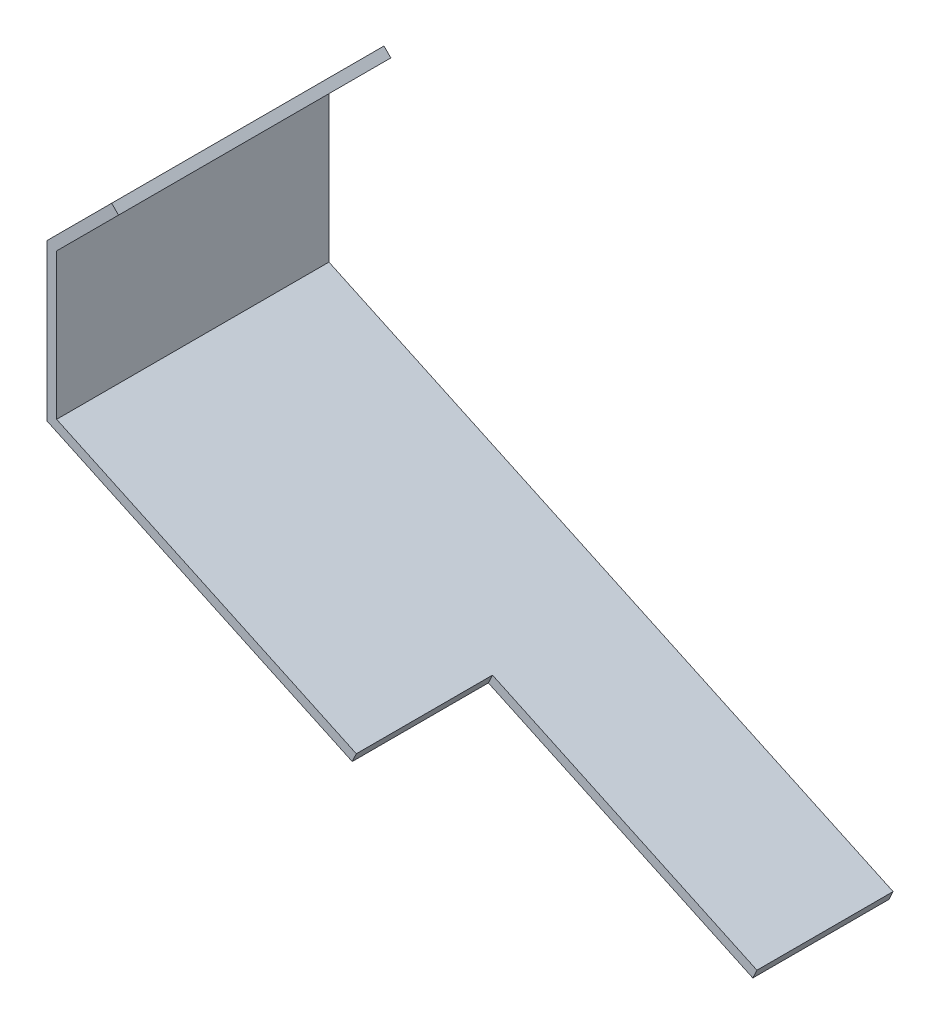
ISO-10303-21;
HEADER;
FILE_DESCRIPTION(('STEP AP214'),'2;1');
FILE_NAME('part.step','',(''),(''),'','','');
FILE_SCHEMA(('AUTOMOTIVE_DESIGN { 1 0 10303 214 1 1 1 1 }'));
ENDSEC;
DATA;
#1=APPLICATION_CONTEXT('core data for automotive mechanical design processes');
#2=APPLICATION_PROTOCOL_DEFINITION('international standard','automotive_design',2000,#1);
#3=PRODUCT_CONTEXT('',#1,'mechanical');
#4=PRODUCT('Part','Part','',(#3));
#5=PRODUCT_RELATED_PRODUCT_CATEGORY('part','',(#4));
#6=PRODUCT_DEFINITION_FORMATION('','',#4);
#7=PRODUCT_DEFINITION_CONTEXT('part definition',#1,'design');
#8=PRODUCT_DEFINITION('design','',#6,#7);
#9=PRODUCT_DEFINITION_SHAPE('','',#8);
#10=(LENGTH_UNIT() NAMED_UNIT(*) SI_UNIT(.MILLI.,.METRE.));
#11=(NAMED_UNIT(*) PLANE_ANGLE_UNIT() SI_UNIT($,.RADIAN.));
#12=(NAMED_UNIT(*) SI_UNIT($,.STERADIAN.) SOLID_ANGLE_UNIT());
#13=UNCERTAINTY_MEASURE_WITH_UNIT(LENGTH_MEASURE(1.E-05),#10,'distance_accuracy_value','');
#14=(GEOMETRIC_REPRESENTATION_CONTEXT(3) GLOBAL_UNCERTAINTY_ASSIGNED_CONTEXT((#13)) GLOBAL_UNIT_ASSIGNED_CONTEXT((#10,
#11,#12)) REPRESENTATION_CONTEXT('',''));
#15=CARTESIAN_POINT('',(0.,0.,0.));
#16=DIRECTION('',(0.,0.,1.));
#17=DIRECTION('',(1.,0.,0.));
#18=AXIS2_PLACEMENT_3D('',#15,#16,#17);
#19=CARTESIAN_POINT('',(0.,75.,70.));
#20=DIRECTION('',(-0.707106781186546,0.707106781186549,0.));
#21=DIRECTION('',(-0.707106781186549,-0.707106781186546,0.));
#22=AXIS2_PLACEMENT_3D('',#19,#20,#21);
#23=PLANE('',#22);
#24=DIRECTION('',(0.707106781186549,0.707106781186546,0.));
#25=VECTOR('',#24,1.);
#26=CARTESIAN_POINT('',(0.,75.,-70.));
#27=LINE('',#26,#25);
#28=CARTESIAN_POINT('',(0.,75.,-70.));
#29=VERTEX_POINT('',#28);
#30=CARTESIAN_POINT('',(31.8198051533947,106.819805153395,-70.));
#31=VERTEX_POINT('',#30);
#32=EDGE_CURVE('E142',#29,#31,#27,.T.);
#33=ORIENTED_EDGE('',*,*,#32,.T.);
#34=DIRECTION('',(0.,0.,-1.));
#35=VECTOR('',#34,1.);
#36=CARTESIAN_POINT('',(31.8198051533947,106.819805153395,70.));
#37=LINE('',#36,#35);
#38=CARTESIAN_POINT('',(31.8198051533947,106.819805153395,70.));
#39=VERTEX_POINT('',#38);
#40=EDGE_CURVE('E169',#39,#31,#37,.T.);
#41=ORIENTED_EDGE('',*,*,#40,.F.);
#42=DIRECTION('',(0.707106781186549,0.707106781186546,0.));
#43=VECTOR('',#42,1.);
#44=CARTESIAN_POINT('',(0.,75.,70.));
#45=LINE('',#44,#43);
#46=CARTESIAN_POINT('',(0.,75.,70.));
#47=VERTEX_POINT('',#46);
#48=EDGE_CURVE('E94',#47,#39,#45,.T.);
#49=ORIENTED_EDGE('',*,*,#48,.F.);
#50=DIRECTION('',(0.,0.,-1.));
#51=VECTOR('',#50,1.);
#52=CARTESIAN_POINT('',(0.,75.,70.));
#53=LINE('',#52,#51);
#54=EDGE_CURVE('E141',#47,#29,#53,.T.);
#55=ORIENTED_EDGE('',*,*,#54,.T.);
#56=EDGE_LOOP('',(#33,#41,#49,#55));
#57=FACE_BOUND('',#56,.T.);
#58=ADVANCED_FACE('F32',(#57),#23,.F.);
#59=CARTESIAN_POINT('',(28.284271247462,110.355339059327,70.));
#60=DIRECTION('',(0.707106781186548,0.707106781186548,0.));
#61=DIRECTION('',(-0.707106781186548,0.707106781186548,0.));
#62=AXIS2_PLACEMENT_3D('',#59,#60,#61);
#63=PLANE('',#62);
#64=DIRECTION('',(0.707106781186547,-0.707106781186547,0.));
#65=VECTOR('',#64,1.);
#66=CARTESIAN_POINT('',(28.284271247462,110.355339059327,-70.));
#67=LINE('',#66,#65);
#68=CARTESIAN_POINT('',(28.284271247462,110.355339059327,-70.));
#69=VERTEX_POINT('',#68);
#70=EDGE_CURVE('E145',#69,#31,#67,.T.);
#71=ORIENTED_EDGE('',*,*,#70,.F.);
#72=DIRECTION('',(0.,0.,-1.));
#73=VECTOR('',#72,1.);
#74=CARTESIAN_POINT('',(28.284271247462,110.355339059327,70.));
#75=LINE('',#74,#73);
#76=CARTESIAN_POINT('',(28.284271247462,110.355339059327,70.));
#77=VERTEX_POINT('',#76);
#78=EDGE_CURVE('E167',#77,#69,#75,.T.);
#79=ORIENTED_EDGE('',*,*,#78,.F.);
#80=DIRECTION('',(0.707106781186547,-0.707106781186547,0.));
#81=VECTOR('',#80,1.);
#82=CARTESIAN_POINT('',(28.284271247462,110.355339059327,70.));
#83=LINE('',#82,#81);
#84=EDGE_CURVE('E135',#77,#39,#83,.T.);
#85=ORIENTED_EDGE('',*,*,#84,.T.);
#86=ORIENTED_EDGE('',*,*,#40,.T.);
#87=EDGE_LOOP('',(#71,#79,#85,#86));
#88=FACE_BOUND('',#87,.T.);
#89=ADVANCED_FACE('F211',(#88),#63,.T.);
#90=CARTESIAN_POINT('',(-3.53553390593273,78.5355339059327,70.));
#91=DIRECTION('',(-0.707106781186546,0.707106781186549,0.));
#92=DIRECTION('',(-0.707106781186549,-0.707106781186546,0.));
#93=AXIS2_PLACEMENT_3D('',#90,#91,#92);
#94=PLANE('',#93);
#95=DIRECTION('',(0.707106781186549,0.707106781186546,0.));
#96=VECTOR('',#95,1.);
#97=CARTESIAN_POINT('',(-3.53553390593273,78.5355339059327,-70.));
#98=LINE('',#97,#96);
#99=CARTESIAN_POINT('',(-5.,77.0710678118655,-70.));
#100=VERTEX_POINT('',#99);
#101=EDGE_CURVE('E148',#100,#69,#98,.T.);
#102=ORIENTED_EDGE('',*,*,#101,.F.);
#103=DIRECTION('',(0.,0.,-1.));
#104=VECTOR('',#103,1.);
#105=CARTESIAN_POINT('',(-5.,77.0710678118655,70.));
#106=LINE('',#105,#104);
#107=CARTESIAN_POINT('',(-5.,77.0710678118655,70.));
#108=VERTEX_POINT('',#107);
#109=EDGE_CURVE('E127',#108,#100,#106,.T.);
#110=ORIENTED_EDGE('',*,*,#109,.F.);
#111=DIRECTION('',(0.707106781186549,0.707106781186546,0.));
#112=VECTOR('',#111,1.);
#113=CARTESIAN_POINT('',(-3.53553390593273,78.5355339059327,70.));
#114=LINE('',#113,#112);
#115=EDGE_CURVE('E133',#108,#77,#114,.T.);
#116=ORIENTED_EDGE('',*,*,#115,.T.);
#117=ORIENTED_EDGE('',*,*,#78,.T.);
#118=EDGE_LOOP('',(#102,#110,#116,#117));
#119=FACE_BOUND('',#118,.T.);
#120=ADVANCED_FACE('F213',(#119),#94,.T.);
#121=CARTESIAN_POINT('',(-5.,0.,70.));
#122=DIRECTION('',(-1.,0.,0.));
#123=DIRECTION('',(0.,0.,1.));
#124=AXIS2_PLACEMENT_3D('',#121,#122,#123);
#125=PLANE('',#124);
#126=DIRECTION('',(0.,1.,0.));
#127=VECTOR('',#126,1.);
#128=CARTESIAN_POINT('',(-5.,0.,-70.));
#129=LINE('',#128,#127);
#130=CARTESIAN_POINT('',(-5.,-3.18535130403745,-70.));
#131=VERTEX_POINT('',#130);
#132=EDGE_CURVE('E125',#131,#100,#129,.T.);
#133=ORIENTED_EDGE('',*,*,#132,.F.);
#134=DIRECTION('',(0.,0.,-1.));
#135=VECTOR('',#134,1.);
#136=CARTESIAN_POINT('',(-5.,-3.18535130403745,70.));
#137=LINE('',#136,#135);
#138=CARTESIAN_POINT('',(-5.,-3.18535130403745,70.));
#139=VERTEX_POINT('',#138);
#140=EDGE_CURVE('E112',#139,#131,#137,.T.);
#141=ORIENTED_EDGE('',*,*,#140,.F.);
#142=DIRECTION('',(0.,1.,0.));
#143=VECTOR('',#142,1.);
#144=CARTESIAN_POINT('',(-5.,0.,70.));
#145=LINE('',#144,#143);
#146=EDGE_CURVE('E119',#139,#108,#145,.T.);
#147=ORIENTED_EDGE('',*,*,#146,.T.);
#148=ORIENTED_EDGE('',*,*,#109,.T.);
#149=EDGE_LOOP('',(#133,#141,#147,#148));
#150=FACE_BOUND('',#149,.T.);
#151=ADVANCED_FACE('F123',(#150),#125,.T.);
#152=CARTESIAN_POINT('',(-2.11309130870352,-4.53153893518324,70.));
#153=DIRECTION('',(-0.422618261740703,-0.906307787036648,0.));
#154=DIRECTION('',(0.906307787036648,-0.422618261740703,0.));
#155=AXIS2_PLACEMENT_3D('',#152,#153,#154);
#156=PLANE('',#155);
#157=DIRECTION('',(0.906307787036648,-0.422618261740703,0.));
#158=VECTOR('',#157,1.);
#159=CARTESIAN_POINT('',(287.905400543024,-139.769382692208,0.));
#160=LINE('',#159,#158);
#161=CARTESIAN_POINT('',(151.959232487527,-76.3766434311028,0.));
#162=VERTEX_POINT('',#161);
#163=CARTESIAN_POINT('',(287.905400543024,-139.769382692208,0.));
#164=VERTEX_POINT('',#163);
#165=EDGE_CURVE('E187',#162,#164,#160,.T.);
#166=ORIENTED_EDGE('',*,*,#165,.F.);
#167=DIRECTION('',(0.,0.,-1.));
#168=VECTOR('',#167,1.);
#169=CARTESIAN_POINT('',(151.959232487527,-76.3766434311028,70.));
#170=LINE('',#169,#168);
#171=CARTESIAN_POINT('',(151.959232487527,-76.3766434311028,70.));
#172=VERTEX_POINT('',#171);
#173=EDGE_CURVE('E116',#172,#162,#170,.T.);
#174=ORIENTED_EDGE('',*,*,#173,.F.);
#175=DIRECTION('',(-0.906307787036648,0.422618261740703,0.));
#176=VECTOR('',#175,1.);
#177=CARTESIAN_POINT('',(-2.11309130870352,-4.53153893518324,70.));
#178=LINE('',#177,#176);
#179=EDGE_CURVE('E107',#172,#139,#178,.T.);
#180=ORIENTED_EDGE('',*,*,#179,.T.);
#181=ORIENTED_EDGE('',*,*,#140,.T.);
#182=DIRECTION('',(-0.906307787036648,0.422618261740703,0.));
#183=VECTOR('',#182,1.);
#184=CARTESIAN_POINT('',(-2.11309130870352,-4.53153893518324,-70.));
#185=LINE('',#184,#183);
#186=CARTESIAN_POINT('',(287.905400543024,-139.769382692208,-70.));
#187=VERTEX_POINT('',#186);
#188=EDGE_CURVE('E152',#187,#131,#185,.T.);
#189=ORIENTED_EDGE('',*,*,#188,.F.);
#190=DIRECTION('',(0.,0.,-1.));
#191=VECTOR('',#190,1.);
#192=CARTESIAN_POINT('',(287.905400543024,-139.769382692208,70.));
#193=LINE('',#192,#191);
#194=EDGE_CURVE('E128',#164,#187,#193,.T.);
#195=ORIENTED_EDGE('',*,*,#194,.F.);
#196=EDGE_LOOP('',(#166,#174,#180,#181,#189,#195));
#197=FACE_BOUND('',#196,.T.);
#198=ADVANCED_FACE('F110',(#197),#156,.T.);
#199=CARTESIAN_POINT('',(290.018491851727,-135.237843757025,70.));
#200=DIRECTION('',(0.906307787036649,-0.422618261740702,0.));
#201=DIRECTION('',(0.422618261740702,0.906307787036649,0.));
#202=AXIS2_PLACEMENT_3D('',#199,#200,#201);
#203=PLANE('',#202);
#204=DIRECTION('',(-0.422618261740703,-0.906307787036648,0.));
#205=VECTOR('',#204,1.);
#206=CARTESIAN_POINT('',(292.131583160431,-130.706304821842,0.));
#207=LINE('',#206,#205);
#208=CARTESIAN_POINT('',(290.018491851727,-135.237843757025,0.));
#209=VERTEX_POINT('',#208);
#210=EDGE_CURVE('E183',#209,#164,#207,.T.);
#211=ORIENTED_EDGE('',*,*,#210,.T.);
#212=ORIENTED_EDGE('',*,*,#194,.T.);
#213=DIRECTION('',(-0.422618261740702,-0.906307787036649,0.));
#214=VECTOR('',#213,1.);
#215=CARTESIAN_POINT('',(290.018491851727,-135.237843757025,-70.));
#216=LINE('',#215,#214);
#217=CARTESIAN_POINT('',(290.018491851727,-135.237843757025,-70.));
#218=VERTEX_POINT('',#217);
#219=EDGE_CURVE('E154',#218,#187,#216,.T.);
#220=ORIENTED_EDGE('',*,*,#219,.F.);
#221=DIRECTION('',(0.,0.,-1.));
#222=VECTOR('',#221,1.);
#223=CARTESIAN_POINT('',(290.018491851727,-135.237843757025,70.));
#224=LINE('',#223,#222);
#225=EDGE_CURVE('E163',#209,#218,#224,.T.);
#226=ORIENTED_EDGE('',*,*,#225,.F.);
#227=EDGE_LOOP('',(#211,#212,#220,#226));
#228=FACE_BOUND('',#227,.T.);
#229=ADVANCED_FACE('F204',(#228),#203,.T.);
#230=CARTESIAN_POINT('',(0.,0.,70.));
#231=DIRECTION('',(-0.422618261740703,-0.906307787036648,0.));
#232=DIRECTION('',(0.906307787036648,-0.422618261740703,0.));
#233=AXIS2_PLACEMENT_3D('',#230,#231,#232);
#234=PLANE('',#233);
#235=DIRECTION('',(0.,0.,-1.));
#236=VECTOR('',#235,1.);
#237=CARTESIAN_POINT('',(154.07232379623,-71.8451044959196,70.));
#238=LINE('',#237,#236);
#239=CARTESIAN_POINT('',(154.07232379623,-71.8451044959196,70.));
#240=VERTEX_POINT('',#239);
#241=CARTESIAN_POINT('',(154.07232379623,-71.8451044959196,0.));
#242=VERTEX_POINT('',#241);
#243=EDGE_CURVE('E46',#240,#242,#238,.T.);
#244=ORIENTED_EDGE('',*,*,#243,.T.);
#245=DIRECTION('',(0.906307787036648,-0.422618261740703,0.));
#246=VECTOR('',#245,1.);
#247=CARTESIAN_POINT('',(0.,0.,0.));
#248=LINE('',#247,#246);
#249=EDGE_CURVE('E11',#242,#209,#248,.T.);
#250=ORIENTED_EDGE('',*,*,#249,.T.);
#251=ORIENTED_EDGE('',*,*,#225,.T.);
#252=DIRECTION('',(-0.906307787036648,0.422618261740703,0.));
#253=VECTOR('',#252,1.);
#254=CARTESIAN_POINT('',(0.,0.,-70.));
#255=LINE('',#254,#253);
#256=CARTESIAN_POINT('',(0.,0.,-70.));
#257=VERTEX_POINT('',#256);
#258=EDGE_CURVE('E157',#218,#257,#255,.T.);
#259=ORIENTED_EDGE('',*,*,#258,.T.);
#260=DIRECTION('',(0.,0.,-1.));
#261=VECTOR('',#260,1.);
#262=CARTESIAN_POINT('',(0.,0.,70.));
#263=LINE('',#262,#261);
#264=CARTESIAN_POINT('',(0.,0.,70.));
#265=VERTEX_POINT('',#264);
#266=EDGE_CURVE('E161',#265,#257,#263,.T.);
#267=ORIENTED_EDGE('',*,*,#266,.F.);
#268=DIRECTION('',(-0.906307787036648,0.422618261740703,0.));
#269=VECTOR('',#268,1.);
#270=CARTESIAN_POINT('',(0.,0.,70.));
#271=LINE('',#270,#269);
#272=EDGE_CURVE('E118',#240,#265,#271,.T.);
#273=ORIENTED_EDGE('',*,*,#272,.F.);
#274=EDGE_LOOP('',(#244,#250,#251,#259,#267,#273));
#275=FACE_BOUND('',#274,.T.);
#276=ADVANCED_FACE('F173',(#275),#234,.F.);
#277=CARTESIAN_POINT('',(0.,0.,70.));
#278=DIRECTION('',(-1.,0.,0.));
#279=DIRECTION('',(0.,0.,1.));
#280=AXIS2_PLACEMENT_3D('',#277,#278,#279);
#281=PLANE('',#280);
#282=DIRECTION('',(0.,1.,0.));
#283=VECTOR('',#282,1.);
#284=CARTESIAN_POINT('',(0.,0.,-70.));
#285=LINE('',#284,#283);
#286=EDGE_CURVE('E88',#257,#29,#285,.T.);
#287=ORIENTED_EDGE('',*,*,#286,.T.);
#288=ORIENTED_EDGE('',*,*,#54,.F.);
#289=DIRECTION('',(0.,1.,0.));
#290=VECTOR('',#289,1.);
#291=CARTESIAN_POINT('',(0.,0.,70.));
#292=LINE('',#291,#290);
#293=EDGE_CURVE('E55',#265,#47,#292,.T.);
#294=ORIENTED_EDGE('',*,*,#293,.F.);
#295=ORIENTED_EDGE('',*,*,#266,.T.);
#296=EDGE_LOOP('',(#287,#288,#294,#295));
#297=FACE_BOUND('',#296,.T.);
#298=ADVANCED_FACE('F176',(#297),#281,.F.);
#299=CARTESIAN_POINT('',(31.8198051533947,106.819805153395,70.));
#300=DIRECTION('',(0.,0.,-1.));
#301=DIRECTION('',(-1.,0.,0.));
#302=AXIS2_PLACEMENT_3D('',#299,#300,#301);
#303=PLANE('',#302);
#304=ORIENTED_EDGE('',*,*,#179,.F.);
#305=DIRECTION('',(0.422618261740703,0.906307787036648,0.));
#306=VECTOR('',#305,1.);
#307=CARTESIAN_POINT('',(200.669897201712,28.0837141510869,70.));
#308=LINE('',#307,#306);
#309=EDGE_CURVE('E39',#172,#240,#308,.T.);
#310=ORIENTED_EDGE('',*,*,#309,.T.);
#311=ORIENTED_EDGE('',*,*,#272,.T.);
#312=ORIENTED_EDGE('',*,*,#293,.T.);
#313=ORIENTED_EDGE('',*,*,#48,.T.);
#314=ORIENTED_EDGE('',*,*,#84,.F.);
#315=ORIENTED_EDGE('',*,*,#115,.F.);
#316=ORIENTED_EDGE('',*,*,#146,.F.);
#317=EDGE_LOOP('',(#304,#310,#311,#312,#313,#314,#315,#316));
#318=FACE_BOUND('',#317,.T.);
#319=ADVANCED_FACE('F131',(#318),#303,.F.);
#320=CARTESIAN_POINT('',(31.8198051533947,106.819805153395,-70.));
#321=DIRECTION('',(0.,0.,-1.));
#322=DIRECTION('',(-1.,0.,0.));
#323=AXIS2_PLACEMENT_3D('',#320,#321,#322);
#324=PLANE('',#323);
#325=ORIENTED_EDGE('',*,*,#32,.F.);
#326=ORIENTED_EDGE('',*,*,#286,.F.);
#327=ORIENTED_EDGE('',*,*,#258,.F.);
#328=ORIENTED_EDGE('',*,*,#219,.T.);
#329=ORIENTED_EDGE('',*,*,#188,.T.);
#330=ORIENTED_EDGE('',*,*,#132,.T.);
#331=ORIENTED_EDGE('',*,*,#101,.T.);
#332=ORIENTED_EDGE('',*,*,#70,.T.);
#333=EDGE_LOOP('',(#325,#326,#327,#328,#329,#330,#331,#332));
#334=FACE_BOUND('',#333,.T.);
#335=ADVANCED_FACE('F207',(#334),#324,.T.);
#336=CARTESIAN_POINT('',(292.131583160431,-130.706304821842,0.));
#337=DIRECTION('',(0.,0.,-1.));
#338=DIRECTION('',(-1.,0.,0.));
#339=AXIS2_PLACEMENT_3D('',#336,#337,#338);
#340=PLANE('',#339);
#341=DIRECTION('',(-0.422618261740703,-0.906307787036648,0.));
#342=VECTOR('',#341,1.);
#343=CARTESIAN_POINT('',(156.185415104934,-67.3135655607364,0.));
#344=LINE('',#343,#342);
#345=EDGE_CURVE('E184',#242,#162,#344,.T.);
#346=ORIENTED_EDGE('',*,*,#345,.T.);
#347=ORIENTED_EDGE('',*,*,#165,.T.);
#348=ORIENTED_EDGE('',*,*,#210,.F.);
#349=ORIENTED_EDGE('',*,*,#249,.F.);
#350=EDGE_LOOP('',(#346,#347,#348,#349));
#351=FACE_BOUND('',#350,.T.);
#352=ADVANCED_FACE('F199',(#351),#340,.F.);
#353=CARTESIAN_POINT('',(156.185415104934,-67.3135655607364,70.));
#354=DIRECTION('',(-0.906307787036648,0.422618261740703,0.));
#355=DIRECTION('',(-0.422618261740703,-0.906307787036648,0.));
#356=AXIS2_PLACEMENT_3D('',#353,#354,#355);
#357=PLANE('',#356);
#358=ORIENTED_EDGE('',*,*,#309,.F.);
#359=ORIENTED_EDGE('',*,*,#173,.T.);
#360=ORIENTED_EDGE('',*,*,#345,.F.);
#361=ORIENTED_EDGE('',*,*,#243,.F.);
#362=EDGE_LOOP('',(#358,#359,#360,#361));
#363=FACE_BOUND('',#362,.T.);
#364=ADVANCED_FACE('F193',(#363),#357,.F.);
#365=CLOSED_SHELL('',(#58,#89,#120,#151,#198,#229,#276,#298,#319,#335,#352,#364));
#366=MANIFOLD_SOLID_BREP('B2',#365);
#367=ADVANCED_BREP_SHAPE_REPRESENTATION('',(#18,#366),#14);
#368=SHAPE_DEFINITION_REPRESENTATION(#9,#367);
ENDSEC;
END-ISO-10303-21;
